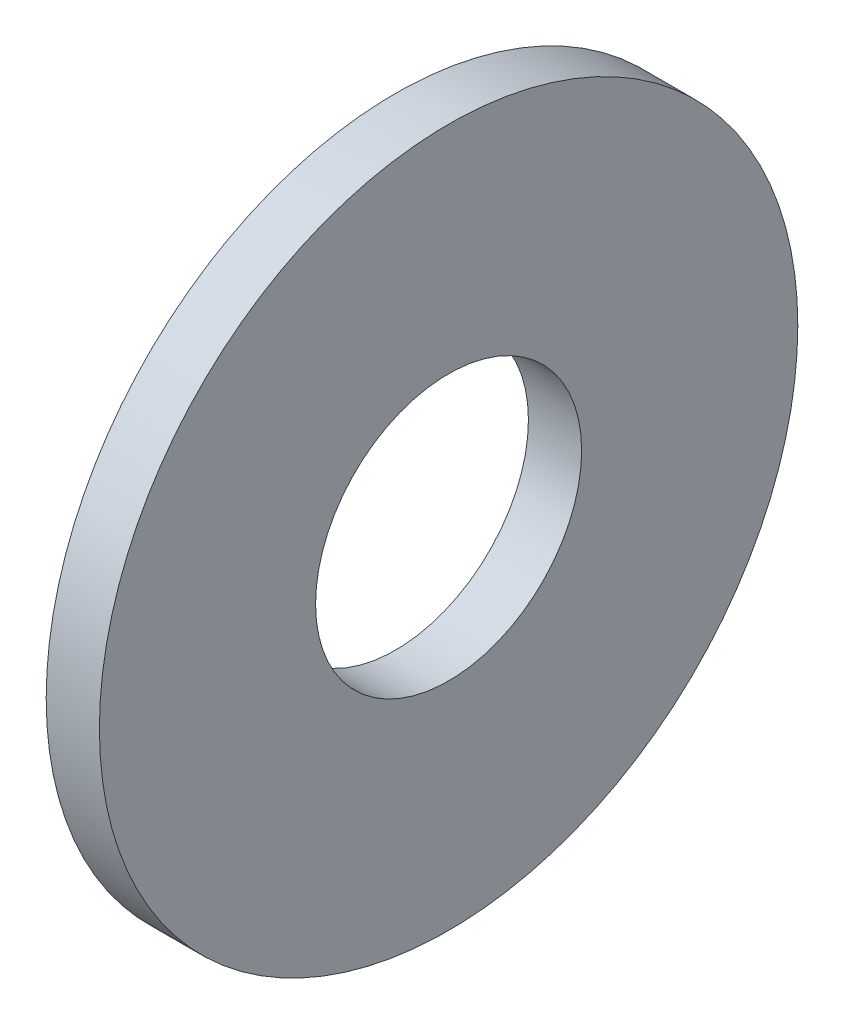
ISO-10303-21;
HEADER;
FILE_DESCRIPTION(('STEP AP214'),'2;1');
FILE_NAME('part.step','',(''),(''),'','','');
FILE_SCHEMA(('AUTOMOTIVE_DESIGN { 1 0 10303 214 1 1 1 1 }'));
ENDSEC;
DATA;
#1=APPLICATION_CONTEXT('core data for automotive mechanical design processes');
#2=APPLICATION_PROTOCOL_DEFINITION('international standard','automotive_design',2000,#1);
#3=PRODUCT_CONTEXT('',#1,'mechanical');
#4=PRODUCT('Part','Part','',(#3));
#5=PRODUCT_RELATED_PRODUCT_CATEGORY('part','',(#4));
#6=PRODUCT_DEFINITION_FORMATION('','',#4);
#7=PRODUCT_DEFINITION_CONTEXT('part definition',#1,'design');
#8=PRODUCT_DEFINITION('design','',#6,#7);
#9=PRODUCT_DEFINITION_SHAPE('','',#8);
#10=(LENGTH_UNIT() NAMED_UNIT(*) SI_UNIT(.MILLI.,.METRE.));
#11=(NAMED_UNIT(*) PLANE_ANGLE_UNIT() SI_UNIT($,.RADIAN.));
#12=(NAMED_UNIT(*) SI_UNIT($,.STERADIAN.) SOLID_ANGLE_UNIT());
#13=UNCERTAINTY_MEASURE_WITH_UNIT(LENGTH_MEASURE(1.E-05),#10,'distance_accuracy_value','');
#14=(GEOMETRIC_REPRESENTATION_CONTEXT(3) GLOBAL_UNCERTAINTY_ASSIGNED_CONTEXT((#13)) GLOBAL_UNIT_ASSIGNED_CONTEXT((#10,
#11,#12)) REPRESENTATION_CONTEXT('',''));
#15=CARTESIAN_POINT('',(0.,0.,0.));
#16=DIRECTION('',(0.,0.,1.));
#17=DIRECTION('',(1.,0.,0.));
#18=AXIS2_PLACEMENT_3D('',#15,#16,#17);
#19=CARTESIAN_POINT('',(-0.8,4.,0.));
#20=DIRECTION('',(-1.,0.,0.));
#21=DIRECTION('',(0.,0.,1.));
#22=AXIS2_PLACEMENT_3D('',#19,#20,#21);
#23=PLANE('',#22);
#24=CARTESIAN_POINT('',(-0.8,0.,0.));
#25=DIRECTION('',(-1.,0.,0.));
#26=DIRECTION('',(0.,0.,1.));
#27=AXIS2_PLACEMENT_3D('',#24,#25,#26);
#28=CIRCLE('',#27,10.5);
#29=CARTESIAN_POINT('',(-0.8,0.,10.5));
#30=VERTEX_POINT('',#29);
#31=EDGE_CURVE('E10',#30,#30,#28,.T.);
#32=ORIENTED_EDGE('',*,*,#31,.T.);
#33=EDGE_LOOP('',(#32));
#34=FACE_BOUND('',#33,.T.);
#35=CARTESIAN_POINT('',(-0.8,0.,0.));
#36=DIRECTION('',(-1.,0.,0.));
#37=DIRECTION('',(0.,0.,1.));
#38=AXIS2_PLACEMENT_3D('',#35,#36,#37);
#39=CIRCLE('',#38,4.);
#40=CARTESIAN_POINT('',(-0.8,0.,4.));
#41=VERTEX_POINT('',#40);
#42=EDGE_CURVE('E47',#41,#41,#39,.T.);
#43=ORIENTED_EDGE('',*,*,#42,.F.);
#44=EDGE_LOOP('',(#43));
#45=FACE_BOUND('',#44,.T.);
#46=ADVANCED_FACE('F33',(#34,#45),#23,.T.);
#47=CARTESIAN_POINT('',(0.8,0.,0.));
#48=DIRECTION('',(-1.,0.,0.));
#49=DIRECTION('',(0.,0.,1.));
#50=AXIS2_PLACEMENT_3D('',#47,#48,#49);
#51=CYLINDRICAL_SURFACE('',#50,10.5);
#52=CARTESIAN_POINT('',(0.8,0.,0.));
#53=DIRECTION('',(-1.,0.,0.));
#54=DIRECTION('',(0.,0.,1.));
#55=AXIS2_PLACEMENT_3D('',#52,#53,#54);
#56=CIRCLE('',#55,10.5);
#57=CARTESIAN_POINT('',(0.8,0.,10.5));
#58=VERTEX_POINT('',#57);
#59=EDGE_CURVE('E39',#58,#58,#56,.T.);
#60=ORIENTED_EDGE('',*,*,#59,.T.);
#61=EDGE_LOOP('',(#60));
#62=FACE_BOUND('',#61,.T.);
#63=ORIENTED_EDGE('',*,*,#31,.F.);
#64=EDGE_LOOP('',(#63));
#65=FACE_BOUND('',#64,.T.);
#66=ADVANCED_FACE('F57',(#62,#65),#51,.T.);
#67=CARTESIAN_POINT('',(0.8,10.5,0.));
#68=DIRECTION('',(1.,0.,0.));
#69=DIRECTION('',(0.,0.,-1.));
#70=AXIS2_PLACEMENT_3D('',#67,#68,#69);
#71=PLANE('',#70);
#72=CARTESIAN_POINT('',(0.8,0.,0.));
#73=DIRECTION('',(-1.,0.,0.));
#74=DIRECTION('',(0.,0.,1.));
#75=AXIS2_PLACEMENT_3D('',#72,#73,#74);
#76=CIRCLE('',#75,4.);
#77=CARTESIAN_POINT('',(0.8,0.,4.));
#78=VERTEX_POINT('',#77);
#79=EDGE_CURVE('E43',#78,#78,#76,.T.);
#80=ORIENTED_EDGE('',*,*,#79,.T.);
#81=EDGE_LOOP('',(#80));
#82=FACE_BOUND('',#81,.T.);
#83=ORIENTED_EDGE('',*,*,#59,.F.);
#84=EDGE_LOOP('',(#83));
#85=FACE_BOUND('',#84,.T.);
#86=ADVANCED_FACE('F61',(#82,#85),#71,.T.);
#87=CARTESIAN_POINT('',(0.8,0.,0.));
#88=DIRECTION('',(-1.,0.,0.));
#89=DIRECTION('',(0.,0.,1.));
#90=AXIS2_PLACEMENT_3D('',#87,#88,#89);
#91=CYLINDRICAL_SURFACE('',#90,4.);
#92=ORIENTED_EDGE('',*,*,#42,.T.);
#93=EDGE_LOOP('',(#92));
#94=FACE_BOUND('',#93,.T.);
#95=ORIENTED_EDGE('',*,*,#79,.F.);
#96=EDGE_LOOP('',(#95));
#97=FACE_BOUND('',#96,.T.);
#98=ADVANCED_FACE('F53',(#94,#97),#91,.F.);
#99=CLOSED_SHELL('',(#46,#66,#86,#98));
#100=MANIFOLD_SOLID_BREP('B2',#99);
#101=ADVANCED_BREP_SHAPE_REPRESENTATION('',(#18,#100),#14);
#102=SHAPE_DEFINITION_REPRESENTATION(#9,#101);
ENDSEC;
END-ISO-10303-21;
